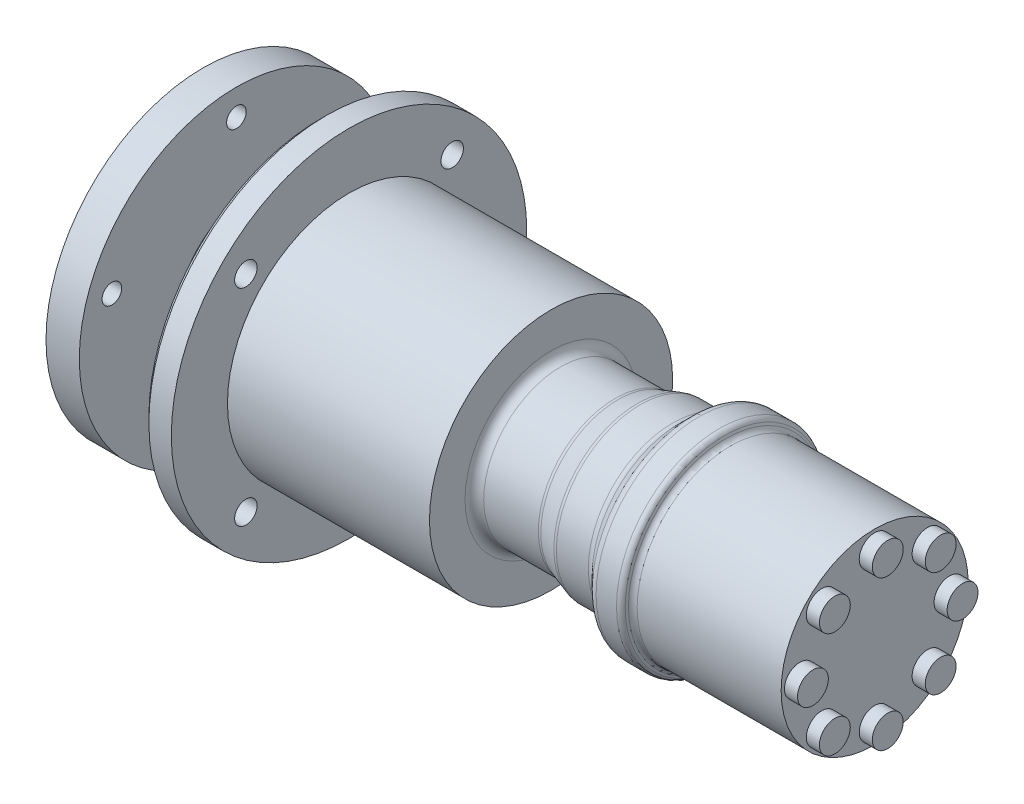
ISO-10303-21;
HEADER;
FILE_DESCRIPTION(('STEP AP214'),'2;1');
FILE_NAME('part.step','',(''),(''),'','','');
FILE_SCHEMA(('AUTOMOTIVE_DESIGN { 1 0 10303 214 1 1 1 1 }'));
ENDSEC;
DATA;
#1=APPLICATION_CONTEXT('core data for automotive mechanical design processes');
#2=APPLICATION_PROTOCOL_DEFINITION('international standard','automotive_design',2000,#1);
#3=PRODUCT_CONTEXT('',#1,'mechanical');
#4=PRODUCT('Part','Part','',(#3));
#5=PRODUCT_RELATED_PRODUCT_CATEGORY('part','',(#4));
#6=PRODUCT_DEFINITION_FORMATION('','',#4);
#7=PRODUCT_DEFINITION_CONTEXT('part definition',#1,'design');
#8=PRODUCT_DEFINITION('design','',#6,#7);
#9=PRODUCT_DEFINITION_SHAPE('','',#8);
#10=(LENGTH_UNIT() NAMED_UNIT(*) SI_UNIT(.MILLI.,.METRE.));
#11=(NAMED_UNIT(*) PLANE_ANGLE_UNIT() SI_UNIT($,.RADIAN.));
#12=(NAMED_UNIT(*) SI_UNIT($,.STERADIAN.) SOLID_ANGLE_UNIT());
#13=UNCERTAINTY_MEASURE_WITH_UNIT(LENGTH_MEASURE(1.E-05),#10,'distance_accuracy_value','');
#14=(GEOMETRIC_REPRESENTATION_CONTEXT(3) GLOBAL_UNCERTAINTY_ASSIGNED_CONTEXT((#13)) GLOBAL_UNIT_ASSIGNED_CONTEXT((#10,
#11,#12)) REPRESENTATION_CONTEXT('',''));
#15=CARTESIAN_POINT('',(0.,0.,0.));
#16=DIRECTION('',(0.,0.,1.));
#17=DIRECTION('',(1.,0.,0.));
#18=AXIS2_PLACEMENT_3D('',#15,#16,#17);
#19=CARTESIAN_POINT('',(366.,50.,0.));
#20=DIRECTION('',(-1.,0.,0.));
#21=DIRECTION('',(0.,0.,1.));
#22=AXIS2_PLACEMENT_3D('',#19,#20,#21);
#23=PLANE('',#22);
#24=CARTESIAN_POINT('',(366.,3.12396592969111E-13,-40.));
#25=DIRECTION('',(-1.,0.,0.));
#26=DIRECTION('',(0.,0.,1.));
#27=AXIS2_PLACEMENT_3D('',#24,#25,#26);
#28=CIRCLE('',#27,8.25);
#29=CARTESIAN_POINT('',(366.,3.12396592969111E-13,-31.75));
#30=VERTEX_POINT('',#29);
#31=EDGE_CURVE('E36',#30,#30,#28,.F.);
#32=ORIENTED_EDGE('',*,*,#31,.F.);
#33=EDGE_LOOP('',(#32));
#34=FACE_BOUND('',#33,.T.);
#35=CARTESIAN_POINT('',(366.,-40.,-2.08264395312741E-13));
#36=DIRECTION('',(-1.,0.,0.));
#37=DIRECTION('',(0.,0.,1.));
#38=AXIS2_PLACEMENT_3D('',#35,#36,#37);
#39=CIRCLE('',#38,8.25);
#40=CARTESIAN_POINT('',(366.,-40.,8.24999999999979));
#41=VERTEX_POINT('',#40);
#42=EDGE_CURVE('E196',#41,#41,#39,.F.);
#43=ORIENTED_EDGE('',*,*,#42,.F.);
#44=EDGE_LOOP('',(#43));
#45=FACE_BOUND('',#44,.T.);
#46=CARTESIAN_POINT('',(366.,-1.0413219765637E-13,40.));
#47=DIRECTION('',(-1.,0.,0.));
#48=DIRECTION('',(0.,0.,1.));
#49=AXIS2_PLACEMENT_3D('',#46,#47,#48);
#50=CIRCLE('',#49,8.25);
#51=CARTESIAN_POINT('',(366.,-1.0413219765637E-13,48.25));
#52=VERTEX_POINT('',#51);
#53=EDGE_CURVE('E190',#52,#52,#50,.F.);
#54=ORIENTED_EDGE('',*,*,#53,.F.);
#55=EDGE_LOOP('',(#54));
#56=FACE_BOUND('',#55,.T.);
#57=CARTESIAN_POINT('',(366.,40.,0.));
#58=DIRECTION('',(-1.,0.,0.));
#59=DIRECTION('',(0.,0.,1.));
#60=AXIS2_PLACEMENT_3D('',#57,#58,#59);
#61=CIRCLE('',#60,8.25);
#62=CARTESIAN_POINT('',(366.,40.,8.25));
#63=VERTEX_POINT('',#62);
#64=EDGE_CURVE('E184',#63,#63,#61,.F.);
#65=ORIENTED_EDGE('',*,*,#64,.F.);
#66=EDGE_LOOP('',(#65));
#67=FACE_BOUND('',#66,.T.);
#68=CARTESIAN_POINT('',(366.,0.,0.));
#69=DIRECTION('',(-1.,0.,0.));
#70=DIRECTION('',(0.,0.,1.));
#71=AXIS2_PLACEMENT_3D('',#68,#69,#70);
#72=CIRCLE('',#71,50.);
#73=CARTESIAN_POINT('',(366.,0.,50.));
#74=VERTEX_POINT('',#73);
#75=EDGE_CURVE('E94',#74,#74,#72,.T.);
#76=ORIENTED_EDGE('',*,*,#75,.F.);
#77=EDGE_LOOP('',(#76));
#78=FACE_BOUND('',#77,.T.);
#79=CARTESIAN_POINT('',(366.,28.2842712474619,28.2842712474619));
#80=DIRECTION('',(-1.,0.,0.));
#81=DIRECTION('',(0.,0.,1.));
#82=AXIS2_PLACEMENT_3D('',#79,#80,#81);
#83=CIRCLE('',#82,8.25);
#84=CARTESIAN_POINT('',(366.,28.2842712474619,36.5342712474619));
#85=VERTEX_POINT('',#84);
#86=EDGE_CURVE('E187',#85,#85,#83,.F.);
#87=ORIENTED_EDGE('',*,*,#86,.F.);
#88=EDGE_LOOP('',(#87));
#89=FACE_BOUND('',#88,.T.);
#90=CARTESIAN_POINT('',(366.,-28.284271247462,28.2842712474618));
#91=DIRECTION('',(-1.,0.,0.));
#92=DIRECTION('',(0.,0.,1.));
#93=AXIS2_PLACEMENT_3D('',#90,#91,#92);
#94=CIRCLE('',#93,8.25);
#95=CARTESIAN_POINT('',(366.,-28.284271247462,36.5342712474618));
#96=VERTEX_POINT('',#95);
#97=EDGE_CURVE('E193',#96,#96,#94,.F.);
#98=ORIENTED_EDGE('',*,*,#97,.F.);
#99=EDGE_LOOP('',(#98));
#100=FACE_BOUND('',#99,.T.);
#101=CARTESIAN_POINT('',(366.,-28.2842712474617,-28.2842712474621));
#102=DIRECTION('',(-1.,0.,0.));
#103=DIRECTION('',(0.,0.,1.));
#104=AXIS2_PLACEMENT_3D('',#101,#102,#103);
#105=CIRCLE('',#104,8.25);
#106=CARTESIAN_POINT('',(366.,-28.2842712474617,-20.0342712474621));
#107=VERTEX_POINT('',#106);
#108=EDGE_CURVE('E41',#107,#107,#105,.F.);
#109=ORIENTED_EDGE('',*,*,#108,.F.);
#110=EDGE_LOOP('',(#109));
#111=FACE_BOUND('',#110,.T.);
#112=CARTESIAN_POINT('',(366.,28.2842712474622,-28.2842712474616));
#113=DIRECTION('',(-1.,0.,0.));
#114=DIRECTION('',(0.,0.,1.));
#115=AXIS2_PLACEMENT_3D('',#112,#113,#114);
#116=CIRCLE('',#115,8.25);
#117=CARTESIAN_POINT('',(366.,28.2842712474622,-20.0342712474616));
#118=VERTEX_POINT('',#117);
#119=EDGE_CURVE('E10',#118,#118,#116,.F.);
#120=ORIENTED_EDGE('',*,*,#119,.F.);
#121=EDGE_LOOP('',(#120));
#122=FACE_BOUND('',#121,.T.);
#123=ADVANCED_FACE('F28',(#34,#45,#56,#67,#78,#89,#100,#111,#122),#23,.F.);
#124=CARTESIAN_POINT('',(0.,0.,0.));
#125=DIRECTION('',(1.,0.,0.));
#126=DIRECTION('',(0.,0.,-1.));
#127=AXIS2_PLACEMENT_3D('',#124,#125,#126);
#128=PLANE('',#127);
#129=CARTESIAN_POINT('',(0.,0.,0.));
#130=DIRECTION('',(-1.,0.,0.));
#131=DIRECTION('',(0.,0.,1.));
#132=AXIS2_PLACEMENT_3D('',#129,#130,#131);
#133=CIRCLE('',#132,42.5);
#134=CARTESIAN_POINT('',(0.,0.,42.5));
#135=VERTEX_POINT('',#134);
#136=EDGE_CURVE('E181',#135,#135,#133,.T.);
#137=ORIENTED_EDGE('',*,*,#136,.T.);
#138=EDGE_LOOP('',(#137));
#139=FACE_BOUND('',#138,.T.);
#140=ADVANCED_FACE('F30',(#139),#128,.F.);
#141=CARTESIAN_POINT('',(0.,0.,0.));
#142=DIRECTION('',(-1.,0.,0.));
#143=DIRECTION('',(0.,0.,1.));
#144=AXIS2_PLACEMENT_3D('',#141,#142,#143);
#145=CYLINDRICAL_SURFACE('',#144,42.5);
#146=ORIENTED_EDGE('',*,*,#136,.F.);
#147=EDGE_LOOP('',(#146));
#148=FACE_BOUND('',#147,.T.);
#149=CARTESIAN_POINT('',(7.,0.,0.));
#150=DIRECTION('',(-1.,0.,0.));
#151=DIRECTION('',(0.,0.,1.));
#152=AXIS2_PLACEMENT_3D('',#149,#150,#151);
#153=CIRCLE('',#152,42.5);
#154=CARTESIAN_POINT('',(7.,0.,42.5));
#155=VERTEX_POINT('',#154);
#156=EDGE_CURVE('E178',#155,#155,#153,.T.);
#157=ORIENTED_EDGE('',*,*,#156,.T.);
#158=EDGE_LOOP('',(#157));
#159=FACE_BOUND('',#158,.T.);
#160=ADVANCED_FACE('F210',(#148,#159),#145,.T.);
#161=CARTESIAN_POINT('',(7.,42.5,0.));
#162=DIRECTION('',(1.,0.,0.));
#163=DIRECTION('',(0.,0.,-1.));
#164=AXIS2_PLACEMENT_3D('',#161,#162,#163);
#165=PLANE('',#164);
#166=CARTESIAN_POINT('',(7.,21.6311896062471,-66.5739561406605));
#167=DIRECTION('',(-1.,0.,0.));
#168=DIRECTION('',(0.,0.95105651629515,0.309016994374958));
#169=AXIS2_PLACEMENT_3D('',#166,#167,#168);
#170=CIRCLE('',#169,5.25);
#171=CARTESIAN_POINT('',(7.,26.6242363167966,-64.951616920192));
#172=VERTEX_POINT('',#171);
#173=EDGE_CURVE('E810',#172,#172,#170,.T.);
#174=ORIENTED_EDGE('',*,*,#173,.F.);
#175=EDGE_LOOP('',(#174));
#176=FACE_BOUND('',#175,.T.);
#177=CARTESIAN_POINT('',(7.,-56.631189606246,-41.1449676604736));
#178=DIRECTION('',(-1.,0.,0.));
#179=DIRECTION('',(0.,0.58778525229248,-0.809016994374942));
#180=AXIS2_PLACEMENT_3D('',#177,#178,#179);
#181=CIRCLE('',#180,5.25);
#182=CARTESIAN_POINT('',(7.,-53.5453170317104,-45.3923068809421));
#183=VERTEX_POINT('',#182);
#184=EDGE_CURVE('E814',#183,#183,#181,.T.);
#185=ORIENTED_EDGE('',*,*,#184,.F.);
#186=EDGE_LOOP('',(#185));
#187=FACE_BOUND('',#186,.T.);
#188=CARTESIAN_POINT('',(7.,-56.6311896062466,41.1449676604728));
#189=DIRECTION('',(-1.,0.,0.));
#190=DIRECTION('',(0.,-0.587785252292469,-0.809016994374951));
#191=AXIS2_PLACEMENT_3D('',#188,#189,#190);
#192=CIRCLE('',#191,5.25);
#193=CARTESIAN_POINT('',(7.,-59.717062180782,36.8976284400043));
#194=VERTEX_POINT('',#193);
#195=EDGE_CURVE('E822',#194,#194,#192,.T.);
#196=ORIENTED_EDGE('',*,*,#195,.F.);
#197=EDGE_LOOP('',(#196));
#198=FACE_BOUND('',#197,.T.);
#199=CARTESIAN_POINT('',(7.,21.6311896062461,66.5739561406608));
#200=DIRECTION('',(-1.,0.,0.));
#201=DIRECTION('',(0.,-0.951056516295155,0.309016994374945));
#202=AXIS2_PLACEMENT_3D('',#199,#200,#201);
#203=CIRCLE('',#202,5.25);
#204=CARTESIAN_POINT('',(7.,16.6381428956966,68.1962953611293));
#205=VERTEX_POINT('',#204);
#206=EDGE_CURVE('E827',#205,#205,#203,.T.);
#207=ORIENTED_EDGE('',*,*,#206,.F.);
#208=EDGE_LOOP('',(#207));
#209=FACE_BOUND('',#208,.T.);
#210=CARTESIAN_POINT('',(7.,70.,0.));
#211=DIRECTION('',(-1.,0.,0.));
#212=DIRECTION('',(0.,0.,1.));
#213=AXIS2_PLACEMENT_3D('',#210,#211,#212);
#214=CIRCLE('',#213,5.25);
#215=CARTESIAN_POINT('',(7.,70.,5.25));
#216=VERTEX_POINT('',#215);
#217=EDGE_CURVE('E833',#216,#216,#214,.T.);
#218=ORIENTED_EDGE('',*,*,#217,.F.);
#219=EDGE_LOOP('',(#218));
#220=FACE_BOUND('',#219,.T.);
#221=ORIENTED_EDGE('',*,*,#156,.F.);
#222=EDGE_LOOP('',(#221));
#223=FACE_BOUND('',#222,.T.);
#224=CARTESIAN_POINT('',(7.,0.,0.));
#225=DIRECTION('',(-1.,0.,0.));
#226=DIRECTION('',(0.,0.,1.));
#227=AXIS2_PLACEMENT_3D('',#224,#225,#226);
#228=CIRCLE('',#227,84.);
#229=CARTESIAN_POINT('',(7.,0.,84.));
#230=VERTEX_POINT('',#229);
#231=EDGE_CURVE('E175',#230,#230,#228,.T.);
#232=ORIENTED_EDGE('',*,*,#231,.T.);
#233=EDGE_LOOP('',(#232));
#234=FACE_BOUND('',#233,.T.);
#235=ADVANCED_FACE('F325',(#176,#187,#198,#209,#220,#223,#234),#165,.F.);
#236=CARTESIAN_POINT('',(0.,0.,0.));
#237=DIRECTION('',(-1.,0.,0.));
#238=DIRECTION('',(0.,0.,1.));
#239=AXIS2_PLACEMENT_3D('',#236,#237,#238);
#240=CYLINDRICAL_SURFACE('',#239,84.);
#241=ORIENTED_EDGE('',*,*,#231,.F.);
#242=EDGE_LOOP('',(#241));
#243=FACE_BOUND('',#242,.T.);
#244=CARTESIAN_POINT('',(24.8,0.,0.));
#245=DIRECTION('',(-1.,0.,0.));
#246=DIRECTION('',(0.,0.,1.));
#247=AXIS2_PLACEMENT_3D('',#244,#245,#246);
#248=CIRCLE('',#247,84.);
#249=CARTESIAN_POINT('',(24.8,0.,84.));
#250=VERTEX_POINT('',#249);
#251=EDGE_CURVE('E172',#250,#250,#248,.T.);
#252=ORIENTED_EDGE('',*,*,#251,.T.);
#253=EDGE_LOOP('',(#252));
#254=FACE_BOUND('',#253,.T.);
#255=ADVANCED_FACE('F321',(#243,#254),#240,.T.);
#256=CARTESIAN_POINT('',(24.8,84.,0.));
#257=DIRECTION('',(-1.,0.,0.));
#258=DIRECTION('',(0.,0.,1.));
#259=AXIS2_PLACEMENT_3D('',#256,#257,#258);
#260=PLANE('',#259);
#261=CARTESIAN_POINT('',(24.8,21.6311896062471,-66.5739561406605));
#262=DIRECTION('',(-1.,0.,0.));
#263=DIRECTION('',(0.,0.,1.));
#264=AXIS2_PLACEMENT_3D('',#261,#262,#263);
#265=CIRCLE('',#264,5.25);
#266=CARTESIAN_POINT('',(24.8,21.6311896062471,-61.3239561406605));
#267=VERTEX_POINT('',#266);
#268=EDGE_CURVE('E813',#267,#267,#265,.F.);
#269=ORIENTED_EDGE('',*,*,#268,.F.);
#270=EDGE_LOOP('',(#269));
#271=FACE_BOUND('',#270,.T.);
#272=CARTESIAN_POINT('',(24.8,-56.631189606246,-41.1449676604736));
#273=DIRECTION('',(-1.,0.,0.));
#274=DIRECTION('',(0.,0.,1.));
#275=AXIS2_PLACEMENT_3D('',#272,#273,#274);
#276=CIRCLE('',#275,5.25);
#277=CARTESIAN_POINT('',(24.8,-56.631189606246,-35.8949676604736));
#278=VERTEX_POINT('',#277);
#279=EDGE_CURVE('E817',#278,#278,#276,.F.);
#280=ORIENTED_EDGE('',*,*,#279,.F.);
#281=EDGE_LOOP('',(#280));
#282=FACE_BOUND('',#281,.T.);
#283=CARTESIAN_POINT('',(24.8,-56.6311896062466,41.1449676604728));
#284=DIRECTION('',(-1.,0.,0.));
#285=DIRECTION('',(0.,0.,1.));
#286=AXIS2_PLACEMENT_3D('',#283,#284,#285);
#287=CIRCLE('',#286,5.25);
#288=CARTESIAN_POINT('',(24.8,-56.6311896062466,46.3949676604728));
#289=VERTEX_POINT('',#288);
#290=EDGE_CURVE('E824',#289,#289,#287,.F.);
#291=ORIENTED_EDGE('',*,*,#290,.F.);
#292=EDGE_LOOP('',(#291));
#293=FACE_BOUND('',#292,.T.);
#294=CARTESIAN_POINT('',(24.8,21.6311896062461,66.5739561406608));
#295=DIRECTION('',(-1.,0.,0.));
#296=DIRECTION('',(0.,0.,1.));
#297=AXIS2_PLACEMENT_3D('',#294,#295,#296);
#298=CIRCLE('',#297,5.25);
#299=CARTESIAN_POINT('',(24.8,21.6311896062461,71.8239561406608));
#300=VERTEX_POINT('',#299);
#301=EDGE_CURVE('E830',#300,#300,#298,.F.);
#302=ORIENTED_EDGE('',*,*,#301,.F.);
#303=EDGE_LOOP('',(#302));
#304=FACE_BOUND('',#303,.T.);
#305=CARTESIAN_POINT('',(24.8,70.,0.));
#306=DIRECTION('',(-1.,0.,0.));
#307=DIRECTION('',(0.,0.,1.));
#308=AXIS2_PLACEMENT_3D('',#305,#306,#307);
#309=CIRCLE('',#308,5.25);
#310=CARTESIAN_POINT('',(24.8,70.,5.25));
#311=VERTEX_POINT('',#310);
#312=EDGE_CURVE('E836',#311,#311,#309,.F.);
#313=ORIENTED_EDGE('',*,*,#312,.F.);
#314=EDGE_LOOP('',(#313));
#315=FACE_BOUND('',#314,.T.);
#316=ORIENTED_EDGE('',*,*,#251,.F.);
#317=EDGE_LOOP('',(#316));
#318=FACE_BOUND('',#317,.T.);
#319=CARTESIAN_POINT('',(24.8,0.,0.));
#320=DIRECTION('',(-1.,0.,0.));
#321=DIRECTION('',(0.,0.,1.));
#322=AXIS2_PLACEMENT_3D('',#319,#320,#321);
#323=CIRCLE('',#322,27.4);
#324=CARTESIAN_POINT('',(24.8,0.,27.4));
#325=VERTEX_POINT('',#324);
#326=EDGE_CURVE('E169',#325,#325,#323,.T.);
#327=ORIENTED_EDGE('',*,*,#326,.T.);
#328=EDGE_LOOP('',(#327));
#329=FACE_BOUND('',#328,.T.);
#330=ADVANCED_FACE('F317',(#271,#282,#293,#304,#315,#318,#329),#260,.F.);
#331=CARTESIAN_POINT('',(0.,0.,0.));
#332=DIRECTION('',(-1.,0.,0.));
#333=DIRECTION('',(0.,0.,1.));
#334=AXIS2_PLACEMENT_3D('',#331,#332,#333);
#335=CYLINDRICAL_SURFACE('',#334,27.4);
#336=ORIENTED_EDGE('',*,*,#326,.F.);
#337=EDGE_LOOP('',(#336));
#338=FACE_BOUND('',#337,.T.);
#339=CARTESIAN_POINT('',(33.,0.,0.));
#340=DIRECTION('',(-1.,0.,0.));
#341=DIRECTION('',(0.,0.,1.));
#342=AXIS2_PLACEMENT_3D('',#339,#340,#341);
#343=CIRCLE('',#342,27.4);
#344=CARTESIAN_POINT('',(33.,0.,27.4));
#345=VERTEX_POINT('',#344);
#346=EDGE_CURVE('E166',#345,#345,#343,.T.);
#347=ORIENTED_EDGE('',*,*,#346,.T.);
#348=EDGE_LOOP('',(#347));
#349=FACE_BOUND('',#348,.T.);
#350=ADVANCED_FACE('F313',(#338,#349),#335,.T.);
#351=CARTESIAN_POINT('',(33.,27.4,0.));
#352=DIRECTION('',(1.,0.,0.));
#353=DIRECTION('',(0.,0.,-1.));
#354=AXIS2_PLACEMENT_3D('',#351,#352,#353);
#355=PLANE('',#354);
#356=ORIENTED_EDGE('',*,*,#346,.F.);
#357=EDGE_LOOP('',(#356));
#358=FACE_BOUND('',#357,.T.);
#359=CARTESIAN_POINT('',(33.,0.,0.));
#360=DIRECTION('',(-1.,0.,0.));
#361=DIRECTION('',(0.,0.,1.));
#362=AXIS2_PLACEMENT_3D('',#359,#360,#361);
#363=CIRCLE('',#362,40.1);
#364=CARTESIAN_POINT('',(33.,0.,40.1));
#365=VERTEX_POINT('',#364);
#366=EDGE_CURVE('E163',#365,#365,#363,.T.);
#367=ORIENTED_EDGE('',*,*,#366,.T.);
#368=EDGE_LOOP('',(#367));
#369=FACE_BOUND('',#368,.T.);
#370=ADVANCED_FACE('F309',(#358,#369),#355,.F.);
#371=CARTESIAN_POINT('',(0.,0.,0.));
#372=DIRECTION('',(-1.,0.,0.));
#373=DIRECTION('',(0.,0.,1.));
#374=AXIS2_PLACEMENT_3D('',#371,#372,#373);
#375=CYLINDRICAL_SURFACE('',#374,40.1);
#376=ORIENTED_EDGE('',*,*,#366,.F.);
#377=EDGE_LOOP('',(#376));
#378=FACE_BOUND('',#377,.T.);
#379=CARTESIAN_POINT('',(37.,0.,0.));
#380=DIRECTION('',(-1.,0.,0.));
#381=DIRECTION('',(0.,0.,1.));
#382=AXIS2_PLACEMENT_3D('',#379,#380,#381);
#383=CIRCLE('',#382,40.1);
#384=CARTESIAN_POINT('',(37.,0.,40.1));
#385=VERTEX_POINT('',#384);
#386=EDGE_CURVE('E160',#385,#385,#383,.T.);
#387=ORIENTED_EDGE('',*,*,#386,.T.);
#388=EDGE_LOOP('',(#387));
#389=FACE_BOUND('',#388,.T.);
#390=ADVANCED_FACE('F305',(#378,#389),#375,.T.);
#391=CARTESIAN_POINT('',(37.,40.1,0.));
#392=DIRECTION('',(1.,0.,0.));
#393=DIRECTION('',(0.,0.,-1.));
#394=AXIS2_PLACEMENT_3D('',#391,#392,#393);
#395=PLANE('',#394);
#396=ORIENTED_EDGE('',*,*,#386,.F.);
#397=EDGE_LOOP('',(#396));
#398=FACE_BOUND('',#397,.T.);
#399=CARTESIAN_POINT('',(37.,0.,0.));
#400=DIRECTION('',(-1.,0.,0.));
#401=DIRECTION('',(0.,0.,1.));
#402=AXIS2_PLACEMENT_3D('',#399,#400,#401);
#403=CIRCLE('',#402,43.9);
#404=CARTESIAN_POINT('',(37.,0.,43.9));
#405=VERTEX_POINT('',#404);
#406=EDGE_CURVE('E157',#405,#405,#403,.T.);
#407=ORIENTED_EDGE('',*,*,#406,.T.);
#408=EDGE_LOOP('',(#407));
#409=FACE_BOUND('',#408,.T.);
#410=ADVANCED_FACE('F301',(#398,#409),#395,.F.);
#411=CARTESIAN_POINT('',(70.,0.,0.));
#412=DIRECTION('',(1.,0.,0.));
#413=DIRECTION('',(0.,0.,-1.));
#414=AXIS2_PLACEMENT_3D('',#411,#412,#413);
#415=CONICAL_SURFACE('',#414,54.9,0.321750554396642);
#416=ORIENTED_EDGE('',*,*,#406,.F.);
#417=EDGE_LOOP('',(#416));
#418=FACE_BOUND('',#417,.T.);
#419=CARTESIAN_POINT('',(70.,0.,0.));
#420=DIRECTION('',(-1.,0.,0.));
#421=DIRECTION('',(0.,0.,1.));
#422=AXIS2_PLACEMENT_3D('',#419,#420,#421);
#423=CIRCLE('',#422,54.9);
#424=CARTESIAN_POINT('',(70.,0.,54.9));
#425=VERTEX_POINT('',#424);
#426=EDGE_CURVE('E154',#425,#425,#423,.T.);
#427=ORIENTED_EDGE('',*,*,#426,.T.);
#428=EDGE_LOOP('',(#427));
#429=FACE_BOUND('',#428,.T.);
#430=ADVANCED_FACE('F297',(#418,#429),#415,.T.);
#431=CARTESIAN_POINT('',(70.,54.9,0.));
#432=DIRECTION('',(1.,0.,0.));
#433=DIRECTION('',(0.,0.,-1.));
#434=AXIS2_PLACEMENT_3D('',#431,#432,#433);
#435=PLANE('',#434);
#436=CARTESIAN_POINT('',(70.,55.15,55.1413424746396));
#437=DIRECTION('',(-1.,0.,0.));
#438=DIRECTION('',(0.,0.,1.));
#439=AXIS2_PLACEMENT_3D('',#436,#437,#438);
#440=CIRCLE('',#439,5.99999999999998);
#441=CARTESIAN_POINT('',(70.,55.15,61.1413424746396));
#442=VERTEX_POINT('',#441);
#443=EDGE_CURVE('E65',#442,#442,#440,.T.);
#444=ORIENTED_EDGE('',*,*,#443,.F.);
#445=EDGE_LOOP('',(#444));
#446=FACE_BOUND('',#445,.T.);
#447=CARTESIAN_POINT('',(70.,-55.15,55.1413424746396));
#448=DIRECTION('',(-1.,0.,0.));
#449=DIRECTION('',(0.,0.,1.));
#450=AXIS2_PLACEMENT_3D('',#447,#448,#449);
#451=CIRCLE('',#450,5.99999999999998);
#452=CARTESIAN_POINT('',(70.,-55.15,61.1413424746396));
#453=VERTEX_POINT('',#452);
#454=EDGE_CURVE('E55',#453,#453,#451,.T.);
#455=ORIENTED_EDGE('',*,*,#454,.F.);
#456=EDGE_LOOP('',(#455));
#457=FACE_BOUND('',#456,.T.);
#458=CARTESIAN_POINT('',(70.,-55.15,-55.1586575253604));
#459=DIRECTION('',(-1.,0.,0.));
#460=DIRECTION('',(0.,0.,1.));
#461=AXIS2_PLACEMENT_3D('',#458,#459,#460);
#462=CIRCLE('',#461,5.99999999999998);
#463=CARTESIAN_POINT('',(70.,-55.15,-49.1586575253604));
#464=VERTEX_POINT('',#463);
#465=EDGE_CURVE('E52',#464,#464,#462,.T.);
#466=ORIENTED_EDGE('',*,*,#465,.F.);
#467=EDGE_LOOP('',(#466));
#468=FACE_BOUND('',#467,.T.);
#469=CARTESIAN_POINT('',(70.,55.15,-55.1586575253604));
#470=DIRECTION('',(-1.,0.,0.));
#471=DIRECTION('',(0.,0.,1.));
#472=AXIS2_PLACEMENT_3D('',#469,#470,#471);
#473=CIRCLE('',#472,5.99999999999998);
#474=CARTESIAN_POINT('',(70.,55.15,-49.1586575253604));
#475=VERTEX_POINT('',#474);
#476=EDGE_CURVE('E49',#475,#475,#473,.T.);
#477=ORIENTED_EDGE('',*,*,#476,.F.);
#478=EDGE_LOOP('',(#477));
#479=FACE_BOUND('',#478,.T.);
#480=ORIENTED_EDGE('',*,*,#426,.F.);
#481=EDGE_LOOP('',(#480));
#482=FACE_BOUND('',#481,.T.);
#483=CARTESIAN_POINT('',(70.,0.,0.));
#484=DIRECTION('',(-1.,0.,0.));
#485=DIRECTION('',(0.,0.,1.));
#486=AXIS2_PLACEMENT_3D('',#483,#484,#485);
#487=CIRCLE('',#486,92.);
#488=CARTESIAN_POINT('',(70.,0.,92.));
#489=VERTEX_POINT('',#488);
#490=EDGE_CURVE('E151',#489,#489,#487,.T.);
#491=ORIENTED_EDGE('',*,*,#490,.T.);
#492=EDGE_LOOP('',(#491));
#493=FACE_BOUND('',#492,.T.);
#494=ADVANCED_FACE('F293',(#446,#457,#468,#479,#482,#493),#435,.F.);
#495=CARTESIAN_POINT('',(73.,0.,0.));
#496=DIRECTION('',(1.,0.,0.));
#497=DIRECTION('',(0.,0.,-1.));
#498=AXIS2_PLACEMENT_3D('',#495,#496,#497);
#499=CONICAL_SURFACE('',#498,95.,0.785398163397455);
#500=ORIENTED_EDGE('',*,*,#490,.F.);
#501=EDGE_LOOP('',(#500));
#502=FACE_BOUND('',#501,.T.);
#503=CARTESIAN_POINT('',(73.,0.,0.));
#504=DIRECTION('',(-1.,0.,0.));
#505=DIRECTION('',(0.,0.,1.));
#506=AXIS2_PLACEMENT_3D('',#503,#504,#505);
#507=CIRCLE('',#506,95.);
#508=CARTESIAN_POINT('',(73.,0.,95.));
#509=VERTEX_POINT('',#508);
#510=EDGE_CURVE('E148',#509,#509,#507,.T.);
#511=ORIENTED_EDGE('',*,*,#510,.T.);
#512=EDGE_LOOP('',(#511));
#513=FACE_BOUND('',#512,.T.);
#514=ADVANCED_FACE('F289',(#502,#513),#499,.T.);
#515=CARTESIAN_POINT('',(0.,0.,0.));
#516=DIRECTION('',(-1.,0.,0.));
#517=DIRECTION('',(0.,0.,1.));
#518=AXIS2_PLACEMENT_3D('',#515,#516,#517);
#519=CYLINDRICAL_SURFACE('',#518,95.);
#520=ORIENTED_EDGE('',*,*,#510,.F.);
#521=EDGE_LOOP('',(#520));
#522=FACE_BOUND('',#521,.T.);
#523=CARTESIAN_POINT('',(85.,0.,0.));
#524=DIRECTION('',(-1.,0.,0.));
#525=DIRECTION('',(0.,0.,1.));
#526=AXIS2_PLACEMENT_3D('',#523,#524,#525);
#527=CIRCLE('',#526,95.);
#528=CARTESIAN_POINT('',(85.,0.,95.));
#529=VERTEX_POINT('',#528);
#530=EDGE_CURVE('E145',#529,#529,#527,.T.);
#531=ORIENTED_EDGE('',*,*,#530,.T.);
#532=EDGE_LOOP('',(#531));
#533=FACE_BOUND('',#532,.T.);
#534=ADVANCED_FACE('F285',(#522,#533),#519,.T.);
#535=CARTESIAN_POINT('',(85.,95.,0.));
#536=DIRECTION('',(-1.,0.,0.));
#537=DIRECTION('',(0.,0.,1.));
#538=AXIS2_PLACEMENT_3D('',#535,#536,#537);
#539=PLANE('',#538);
#540=CARTESIAN_POINT('',(85.,55.15,55.1413424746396));
#541=DIRECTION('',(-1.,0.,0.));
#542=DIRECTION('',(0.,0.,1.));
#543=AXIS2_PLACEMENT_3D('',#540,#541,#542);
#544=CIRCLE('',#543,5.99999999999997);
#545=CARTESIAN_POINT('',(85.,55.15,61.1413424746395));
#546=VERTEX_POINT('',#545);
#547=EDGE_CURVE('E32',#546,#546,#544,.T.);
#548=ORIENTED_EDGE('',*,*,#547,.T.);
#549=EDGE_LOOP('',(#548));
#550=FACE_BOUND('',#549,.T.);
#551=CARTESIAN_POINT('',(85.,-55.15,55.1413424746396));
#552=DIRECTION('',(-1.,0.,0.));
#553=DIRECTION('',(0.,0.,1.));
#554=AXIS2_PLACEMENT_3D('',#551,#552,#553);
#555=CIRCLE('',#554,5.99999999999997);
#556=CARTESIAN_POINT('',(85.,-55.15,61.1413424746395));
#557=VERTEX_POINT('',#556);
#558=EDGE_CURVE('E53',#557,#557,#555,.T.);
#559=ORIENTED_EDGE('',*,*,#558,.T.);
#560=EDGE_LOOP('',(#559));
#561=FACE_BOUND('',#560,.T.);
#562=CARTESIAN_POINT('',(85.,-55.15,-55.1586575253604));
#563=DIRECTION('',(-1.,0.,0.));
#564=DIRECTION('',(0.,0.,1.));
#565=AXIS2_PLACEMENT_3D('',#562,#563,#564);
#566=CIRCLE('',#565,5.99999999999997);
#567=CARTESIAN_POINT('',(85.,-55.15,-49.1586575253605));
#568=VERTEX_POINT('',#567);
#569=EDGE_CURVE('E50',#568,#568,#566,.T.);
#570=ORIENTED_EDGE('',*,*,#569,.T.);
#571=EDGE_LOOP('',(#570));
#572=FACE_BOUND('',#571,.T.);
#573=CARTESIAN_POINT('',(85.,55.15,-55.1586575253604));
#574=DIRECTION('',(-1.,0.,0.));
#575=DIRECTION('',(0.,0.,1.));
#576=AXIS2_PLACEMENT_3D('',#573,#574,#575);
#577=CIRCLE('',#576,5.99999999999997);
#578=CARTESIAN_POINT('',(85.,55.15,-49.1586575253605));
#579=VERTEX_POINT('',#578);
#580=EDGE_CURVE('E45',#579,#579,#577,.T.);
#581=ORIENTED_EDGE('',*,*,#580,.T.);
#582=EDGE_LOOP('',(#581));
#583=FACE_BOUND('',#582,.T.);
#584=ORIENTED_EDGE('',*,*,#530,.F.);
#585=EDGE_LOOP('',(#584));
#586=FACE_BOUND('',#585,.T.);
#587=CARTESIAN_POINT('',(85.,0.,0.));
#588=DIRECTION('',(-1.,0.,0.));
#589=DIRECTION('',(0.,0.,1.));
#590=AXIS2_PLACEMENT_3D('',#587,#588,#589);
#591=CIRCLE('',#590,65.);
#592=CARTESIAN_POINT('',(85.,0.,65.));
#593=VERTEX_POINT('',#592);
#594=EDGE_CURVE('E142',#593,#593,#591,.T.);
#595=ORIENTED_EDGE('',*,*,#594,.T.);
#596=EDGE_LOOP('',(#595));
#597=FACE_BOUND('',#596,.T.);
#598=ADVANCED_FACE('F281',(#550,#561,#572,#583,#586,#597),#539,.F.);
#599=CARTESIAN_POINT('',(0.,0.,0.));
#600=DIRECTION('',(-1.,0.,0.));
#601=DIRECTION('',(0.,0.,1.));
#602=AXIS2_PLACEMENT_3D('',#599,#600,#601);
#603=CYLINDRICAL_SURFACE('',#602,65.);
#604=ORIENTED_EDGE('',*,*,#594,.F.);
#605=EDGE_LOOP('',(#604));
#606=FACE_BOUND('',#605,.T.);
#607=CARTESIAN_POINT('',(193.,0.,0.));
#608=DIRECTION('',(-1.,0.,0.));
#609=DIRECTION('',(0.,0.,1.));
#610=AXIS2_PLACEMENT_3D('',#607,#608,#609);
#611=CIRCLE('',#610,65.);
#612=CARTESIAN_POINT('',(193.,0.,65.));
#613=VERTEX_POINT('',#612);
#614=EDGE_CURVE('E139',#613,#613,#611,.T.);
#615=ORIENTED_EDGE('',*,*,#614,.T.);
#616=EDGE_LOOP('',(#615));
#617=FACE_BOUND('',#616,.T.);
#618=ADVANCED_FACE('F277',(#606,#617),#603,.T.);
#619=CARTESIAN_POINT('',(193.,65.,0.));
#620=DIRECTION('',(-1.,0.,0.));
#621=DIRECTION('',(0.,0.,1.));
#622=AXIS2_PLACEMENT_3D('',#619,#620,#621);
#623=PLANE('',#622);
#624=ORIENTED_EDGE('',*,*,#614,.F.);
#625=EDGE_LOOP('',(#624));
#626=FACE_BOUND('',#625,.T.);
#627=CARTESIAN_POINT('',(193.,0.,0.));
#628=DIRECTION('',(-1.,0.,0.));
#629=DIRECTION('',(0.,0.,1.));
#630=AXIS2_PLACEMENT_3D('',#627,#628,#629);
#631=CIRCLE('',#630,46.);
#632=CARTESIAN_POINT('',(193.,0.,46.));
#633=VERTEX_POINT('',#632);
#634=EDGE_CURVE('E136',#633,#633,#631,.T.);
#635=ORIENTED_EDGE('',*,*,#634,.T.);
#636=EDGE_LOOP('',(#635));
#637=FACE_BOUND('',#636,.T.);
#638=ADVANCED_FACE('F273',(#626,#637),#623,.F.);
#639=CARTESIAN_POINT('',(198.,0.,0.));
#640=DIRECTION('',(-1.,0.,0.));
#641=DIRECTION('',(0.,0.,1.));
#642=AXIS2_PLACEMENT_3D('',#639,#640,#641);
#643=TOROIDAL_SURFACE('',#642,46.,5.);
#644=ORIENTED_EDGE('',*,*,#634,.F.);
#645=EDGE_LOOP('',(#644));
#646=FACE_BOUND('',#645,.T.);
#647=CARTESIAN_POINT('',(198.,0.,0.));
#648=DIRECTION('',(-1.,0.,0.));
#649=DIRECTION('',(0.,0.,1.));
#650=AXIS2_PLACEMENT_3D('',#647,#648,#649);
#651=CIRCLE('',#650,41.);
#652=CARTESIAN_POINT('',(198.,0.,41.));
#653=VERTEX_POINT('',#652);
#654=EDGE_CURVE('E133',#653,#653,#651,.T.);
#655=ORIENTED_EDGE('',*,*,#654,.T.);
#656=EDGE_LOOP('',(#655));
#657=FACE_BOUND('',#656,.T.);
#658=ADVANCED_FACE('F269',(#646,#657),#643,.F.);
#659=CARTESIAN_POINT('',(0.,0.,0.));
#660=DIRECTION('',(-1.,0.,0.));
#661=DIRECTION('',(0.,0.,1.));
#662=AXIS2_PLACEMENT_3D('',#659,#660,#661);
#663=CYLINDRICAL_SURFACE('',#662,41.);
#664=ORIENTED_EDGE('',*,*,#654,.F.);
#665=EDGE_LOOP('',(#664));
#666=FACE_BOUND('',#665,.T.);
#667=CARTESIAN_POINT('',(227.188611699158,0.,0.));
#668=DIRECTION('',(-1.,0.,0.));
#669=DIRECTION('',(0.,0.,1.));
#670=AXIS2_PLACEMENT_3D('',#667,#668,#669);
#671=CIRCLE('',#670,41.);
#672=CARTESIAN_POINT('',(227.188611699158,0.,41.));
#673=VERTEX_POINT('',#672);
#674=EDGE_CURVE('E130',#673,#673,#671,.T.);
#675=ORIENTED_EDGE('',*,*,#674,.T.);
#676=EDGE_LOOP('',(#675));
#677=FACE_BOUND('',#676,.T.);
#678=ADVANCED_FACE('F265',(#666,#677),#663,.T.);
#679=CARTESIAN_POINT('',(227.188611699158,0.,0.));
#680=DIRECTION('',(-1.,0.,0.));
#681=DIRECTION('',(0.,0.,1.));
#682=AXIS2_PLACEMENT_3D('',#679,#680,#681);
#683=TOROIDAL_SURFACE('',#682,46.,5.);
#684=ORIENTED_EDGE('',*,*,#674,.F.);
#685=EDGE_LOOP('',(#684));
#686=FACE_BOUND('',#685,.T.);
#687=CARTESIAN_POINT('',(228.769750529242,0.,0.));
#688=DIRECTION('',(-1.,0.,0.));
#689=DIRECTION('',(0.,0.,1.));
#690=AXIS2_PLACEMENT_3D('',#687,#688,#689);
#691=CIRCLE('',#690,41.2565835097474);
#692=CARTESIAN_POINT('',(228.769750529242,0.,41.2565835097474));
#693=VERTEX_POINT('',#692);
#694=EDGE_CURVE('E127',#693,#693,#691,.T.);
#695=ORIENTED_EDGE('',*,*,#694,.T.);
#696=EDGE_LOOP('',(#695));
#697=FACE_BOUND('',#696,.T.);
#698=ADVANCED_FACE('F261',(#686,#697),#683,.F.);
#699=CARTESIAN_POINT('',(239.230249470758,0.,0.));
#700=DIRECTION('',(1.,0.,0.));
#701=DIRECTION('',(0.,0.,-1.));
#702=AXIS2_PLACEMENT_3D('',#699,#700,#701);
#703=CONICAL_SURFACE('',#702,44.7434164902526,0.321750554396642);
#704=ORIENTED_EDGE('',*,*,#694,.F.);
#705=EDGE_LOOP('',(#704));
#706=FACE_BOUND('',#705,.T.);
#707=CARTESIAN_POINT('',(239.230249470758,0.,0.));
#708=DIRECTION('',(-1.,0.,0.));
#709=DIRECTION('',(0.,0.,1.));
#710=AXIS2_PLACEMENT_3D('',#707,#708,#709);
#711=CIRCLE('',#710,44.7434164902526);
#712=CARTESIAN_POINT('',(239.230249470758,0.,44.7434164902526));
#713=VERTEX_POINT('',#712);
#714=EDGE_CURVE('E124',#713,#713,#711,.T.);
#715=ORIENTED_EDGE('',*,*,#714,.T.);
#716=EDGE_LOOP('',(#715));
#717=FACE_BOUND('',#716,.T.);
#718=ADVANCED_FACE('F257',(#706,#717),#703,.T.);
#719=CARTESIAN_POINT('',(240.811388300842,0.,0.));
#720=DIRECTION('',(-1.,0.,0.));
#721=DIRECTION('',(0.,0.,1.));
#722=AXIS2_PLACEMENT_3D('',#719,#720,#721);
#723=TOROIDAL_SURFACE('',#722,40.,5.);
#724=ORIENTED_EDGE('',*,*,#714,.F.);
#725=EDGE_LOOP('',(#724));
#726=FACE_BOUND('',#725,.T.);
#727=CARTESIAN_POINT('',(240.811388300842,0.,0.));
#728=DIRECTION('',(-1.,0.,0.));
#729=DIRECTION('',(0.,0.,1.));
#730=AXIS2_PLACEMENT_3D('',#727,#728,#729);
#731=CIRCLE('',#730,45.);
#732=CARTESIAN_POINT('',(240.811388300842,0.,45.));
#733=VERTEX_POINT('',#732);
#734=EDGE_CURVE('E121',#733,#733,#731,.T.);
#735=ORIENTED_EDGE('',*,*,#734,.T.);
#736=EDGE_LOOP('',(#735));
#737=FACE_BOUND('',#736,.T.);
#738=ADVANCED_FACE('F253',(#726,#737),#723,.T.);
#739=CARTESIAN_POINT('',(0.,0.,0.));
#740=DIRECTION('',(-1.,0.,0.));
#741=DIRECTION('',(0.,0.,1.));
#742=AXIS2_PLACEMENT_3D('',#739,#740,#741);
#743=CYLINDRICAL_SURFACE('',#742,45.);
#744=ORIENTED_EDGE('',*,*,#734,.F.);
#745=EDGE_LOOP('',(#744));
#746=FACE_BOUND('',#745,.T.);
#747=CARTESIAN_POINT('',(257.928932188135,0.,0.));
#748=DIRECTION('',(-1.,0.,0.));
#749=DIRECTION('',(0.,0.,1.));
#750=AXIS2_PLACEMENT_3D('',#747,#748,#749);
#751=CIRCLE('',#750,45.);
#752=CARTESIAN_POINT('',(257.928932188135,0.,45.));
#753=VERTEX_POINT('',#752);
#754=EDGE_CURVE('E118',#753,#753,#751,.T.);
#755=ORIENTED_EDGE('',*,*,#754,.T.);
#756=EDGE_LOOP('',(#755));
#757=FACE_BOUND('',#756,.T.);
#758=ADVANCED_FACE('F249',(#746,#757),#743,.T.);
#759=CARTESIAN_POINT('',(257.928932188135,0.,0.));
#760=DIRECTION('',(-1.,0.,0.));
#761=DIRECTION('',(0.,0.,1.));
#762=AXIS2_PLACEMENT_3D('',#759,#760,#761);
#763=TOROIDAL_SURFACE('',#762,50.,5.00000000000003);
#764=ORIENTED_EDGE('',*,*,#754,.F.);
#765=EDGE_LOOP('',(#764));
#766=FACE_BOUND('',#765,.T.);
#767=CARTESIAN_POINT('',(261.464466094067,0.,0.));
#768=DIRECTION('',(-1.,0.,0.));
#769=DIRECTION('',(0.,0.,1.));
#770=AXIS2_PLACEMENT_3D('',#767,#768,#769);
#771=CIRCLE('',#770,46.4644660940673);
#772=CARTESIAN_POINT('',(261.464466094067,0.,46.4644660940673));
#773=VERTEX_POINT('',#772);
#774=EDGE_CURVE('E115',#773,#773,#771,.T.);
#775=ORIENTED_EDGE('',*,*,#774,.T.);
#776=EDGE_LOOP('',(#775));
#777=FACE_BOUND('',#776,.T.);
#778=ADVANCED_FACE('F245',(#766,#777),#763,.F.);
#779=CARTESIAN_POINT('',(268.535533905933,0.,0.));
#780=DIRECTION('',(1.,0.,0.));
#781=DIRECTION('',(0.,0.,-1.));
#782=AXIS2_PLACEMENT_3D('',#779,#780,#781);
#783=CONICAL_SURFACE('',#782,53.5355339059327,0.785398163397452);
#784=ORIENTED_EDGE('',*,*,#774,.F.);
#785=EDGE_LOOP('',(#784));
#786=FACE_BOUND('',#785,.T.);
#787=CARTESIAN_POINT('',(268.535533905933,0.,0.));
#788=DIRECTION('',(-1.,0.,0.));
#789=DIRECTION('',(0.,0.,1.));
#790=AXIS2_PLACEMENT_3D('',#787,#788,#789);
#791=CIRCLE('',#790,53.5355339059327);
#792=CARTESIAN_POINT('',(268.535533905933,0.,53.5355339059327));
#793=VERTEX_POINT('',#792);
#794=EDGE_CURVE('E112',#793,#793,#791,.T.);
#795=ORIENTED_EDGE('',*,*,#794,.T.);
#796=EDGE_LOOP('',(#795));
#797=FACE_BOUND('',#796,.T.);
#798=ADVANCED_FACE('F241',(#786,#797),#783,.T.);
#799=CARTESIAN_POINT('',(272.071067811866,0.,0.));
#800=DIRECTION('',(-1.,0.,0.));
#801=DIRECTION('',(0.,0.,1.));
#802=AXIS2_PLACEMENT_3D('',#799,#800,#801);
#803=TOROIDAL_SURFACE('',#802,50.,5.);
#804=ORIENTED_EDGE('',*,*,#794,.F.);
#805=EDGE_LOOP('',(#804));
#806=FACE_BOUND('',#805,.T.);
#807=CARTESIAN_POINT('',(272.071067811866,0.,0.));
#808=DIRECTION('',(-1.,0.,0.));
#809=DIRECTION('',(0.,0.,1.));
#810=AXIS2_PLACEMENT_3D('',#807,#808,#809);
#811=CIRCLE('',#810,55.);
#812=CARTESIAN_POINT('',(272.071067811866,0.,55.));
#813=VERTEX_POINT('',#812);
#814=EDGE_CURVE('E109',#813,#813,#811,.T.);
#815=ORIENTED_EDGE('',*,*,#814,.T.);
#816=EDGE_LOOP('',(#815));
#817=FACE_BOUND('',#816,.T.);
#818=ADVANCED_FACE('F237',(#806,#817),#803,.T.);
#819=CARTESIAN_POINT('',(0.,0.,0.));
#820=DIRECTION('',(-1.,0.,0.));
#821=DIRECTION('',(0.,0.,1.));
#822=AXIS2_PLACEMENT_3D('',#819,#820,#821);
#823=CYLINDRICAL_SURFACE('',#822,55.);
#824=ORIENTED_EDGE('',*,*,#814,.F.);
#825=EDGE_LOOP('',(#824));
#826=FACE_BOUND('',#825,.T.);
#827=CARTESIAN_POINT('',(282.968901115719,0.,0.));
#828=DIRECTION('',(-1.,0.,0.));
#829=DIRECTION('',(0.,0.,1.));
#830=AXIS2_PLACEMENT_3D('',#827,#828,#829);
#831=CIRCLE('',#830,55.);
#832=CARTESIAN_POINT('',(282.968901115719,0.,55.));
#833=VERTEX_POINT('',#832);
#834=EDGE_CURVE('E106',#833,#833,#831,.T.);
#835=ORIENTED_EDGE('',*,*,#834,.T.);
#836=EDGE_LOOP('',(#835));
#837=FACE_BOUND('',#836,.T.);
#838=ADVANCED_FACE('F233',(#826,#837),#823,.T.);
#839=CARTESIAN_POINT('',(282.968901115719,0.,0.));
#840=DIRECTION('',(-1.,0.,0.));
#841=DIRECTION('',(0.,0.,1.));
#842=AXIS2_PLACEMENT_3D('',#839,#840,#841);
#843=TOROIDAL_SURFACE('',#842,52.,3.00000000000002);
#844=ORIENTED_EDGE('',*,*,#834,.F.);
#845=EDGE_LOOP('',(#844));
#846=FACE_BOUND('',#845,.T.);
#847=CARTESIAN_POINT('',(285.754331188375,0.,0.));
#848=DIRECTION('',(-1.,0.,0.));
#849=DIRECTION('',(0.,0.,1.));
#850=AXIS2_PLACEMENT_3D('',#847,#848,#849);
#851=CIRCLE('',#850,53.1141720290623);
#852=CARTESIAN_POINT('',(285.754331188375,0.,53.1141720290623));
#853=VERTEX_POINT('',#852);
#854=EDGE_CURVE('E103',#853,#853,#851,.T.);
#855=ORIENTED_EDGE('',*,*,#854,.T.);
#856=EDGE_LOOP('',(#855));
#857=FACE_BOUND('',#856,.T.);
#858=ADVANCED_FACE('F229',(#846,#857),#843,.T.);
#859=CARTESIAN_POINT('',(286.245668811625,0.,0.));
#860=DIRECTION('',(-1.,0.,0.));
#861=DIRECTION('',(0.,0.,1.));
#862=AXIS2_PLACEMENT_3D('',#859,#860,#861);
#863=CONICAL_SURFACE('',#862,51.8858279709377,1.1902899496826);
#864=ORIENTED_EDGE('',*,*,#854,.F.);
#865=EDGE_LOOP('',(#864));
#866=FACE_BOUND('',#865,.T.);
#867=CARTESIAN_POINT('',(286.245668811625,0.,0.));
#868=DIRECTION('',(-1.,0.,0.));
#869=DIRECTION('',(0.,0.,1.));
#870=AXIS2_PLACEMENT_3D('',#867,#868,#869);
#871=CIRCLE('',#870,51.8858279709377);
#872=CARTESIAN_POINT('',(286.245668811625,0.,51.8858279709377));
#873=VERTEX_POINT('',#872);
#874=EDGE_CURVE('E100',#873,#873,#871,.T.);
#875=ORIENTED_EDGE('',*,*,#874,.T.);
#876=EDGE_LOOP('',(#875));
#877=FACE_BOUND('',#876,.T.);
#878=ADVANCED_FACE('F225',(#866,#877),#863,.T.);
#879=CARTESIAN_POINT('',(289.031098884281,0.,0.));
#880=DIRECTION('',(-1.,0.,0.));
#881=DIRECTION('',(0.,0.,1.));
#882=AXIS2_PLACEMENT_3D('',#879,#880,#881);
#883=TOROIDAL_SURFACE('',#882,53.,3.00000000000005);
#884=ORIENTED_EDGE('',*,*,#874,.F.);
#885=EDGE_LOOP('',(#884));
#886=FACE_BOUND('',#885,.T.);
#887=CARTESIAN_POINT('',(289.031098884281,0.,0.));
#888=DIRECTION('',(-1.,0.,0.));
#889=DIRECTION('',(0.,0.,1.));
#890=AXIS2_PLACEMENT_3D('',#887,#888,#889);
#891=CIRCLE('',#890,50.);
#892=CARTESIAN_POINT('',(289.031098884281,0.,50.));
#893=VERTEX_POINT('',#892);
#894=EDGE_CURVE('E97',#893,#893,#891,.T.);
#895=ORIENTED_EDGE('',*,*,#894,.T.);
#896=EDGE_LOOP('',(#895));
#897=FACE_BOUND('',#896,.T.);
#898=ADVANCED_FACE('F221',(#886,#897),#883,.F.);
#899=CARTESIAN_POINT('',(0.,0.,0.));
#900=DIRECTION('',(-1.,0.,0.));
#901=DIRECTION('',(0.,0.,1.));
#902=AXIS2_PLACEMENT_3D('',#899,#900,#901);
#903=CYLINDRICAL_SURFACE('',#902,50.);
#904=ORIENTED_EDGE('',*,*,#894,.F.);
#905=EDGE_LOOP('',(#904));
#906=FACE_BOUND('',#905,.T.);
#907=ORIENTED_EDGE('',*,*,#75,.T.);
#908=EDGE_LOOP('',(#907));
#909=FACE_BOUND('',#908,.T.);
#910=ADVANCED_FACE('F218',(#906,#909),#903,.T.);
#911=CARTESIAN_POINT('',(373.,40.,0.));
#912=DIRECTION('',(-1.,0.,0.));
#913=DIRECTION('',(0.,0.,1.));
#914=AXIS2_PLACEMENT_3D('',#911,#912,#913);
#915=CYLINDRICAL_SURFACE('',#914,8.25);
#916=CARTESIAN_POINT('',(373.,40.,0.));
#917=DIRECTION('',(1.,0.,0.));
#918=DIRECTION('',(0.,0.,-1.));
#919=AXIS2_PLACEMENT_3D('',#916,#917,#918);
#920=CIRCLE('',#919,8.25);
#921=CARTESIAN_POINT('',(373.,40.,-8.25));
#922=VERTEX_POINT('',#921);
#923=EDGE_CURVE('E91',#922,#922,#920,.T.);
#924=ORIENTED_EDGE('',*,*,#923,.F.);
#925=EDGE_LOOP('',(#924));
#926=FACE_BOUND('',#925,.T.);
#927=ORIENTED_EDGE('',*,*,#64,.T.);
#928=EDGE_LOOP('',(#927));
#929=FACE_BOUND('',#928,.T.);
#930=ADVANCED_FACE('F216',(#926,#929),#915,.T.);
#931=CARTESIAN_POINT('',(373.,40.,0.));
#932=DIRECTION('',(1.,0.,0.));
#933=DIRECTION('',(0.,0.,-1.));
#934=AXIS2_PLACEMENT_3D('',#931,#932,#933);
#935=PLANE('',#934);
#936=ORIENTED_EDGE('',*,*,#923,.T.);
#937=EDGE_LOOP('',(#936));
#938=FACE_BOUND('',#937,.T.);
#939=ADVANCED_FACE('F430',(#938),#935,.T.);
#940=CARTESIAN_POINT('',(373.,28.2842712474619,28.2842712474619));
#941=DIRECTION('',(-1.,0.,0.));
#942=DIRECTION('',(0.,0.,1.));
#943=AXIS2_PLACEMENT_3D('',#940,#941,#942);
#944=CYLINDRICAL_SURFACE('',#943,8.25);
#945=CARTESIAN_POINT('',(373.,28.2842712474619,28.2842712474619));
#946=DIRECTION('',(1.,0.,0.));
#947=DIRECTION('',(0.,0.707106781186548,-0.707106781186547));
#948=AXIS2_PLACEMENT_3D('',#945,#946,#947);
#949=CIRCLE('',#948,8.25);
#950=CARTESIAN_POINT('',(373.,34.1179021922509,22.4506403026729));
#951=VERTEX_POINT('',#950);
#952=EDGE_CURVE('E88',#951,#951,#949,.T.);
#953=ORIENTED_EDGE('',*,*,#952,.F.);
#954=EDGE_LOOP('',(#953));
#955=FACE_BOUND('',#954,.T.);
#956=ORIENTED_EDGE('',*,*,#86,.T.);
#957=EDGE_LOOP('',(#956));
#958=FACE_BOUND('',#957,.T.);
#959=ADVANCED_FACE('F427',(#955,#958),#944,.T.);
#960=CARTESIAN_POINT('',(373.,28.2842712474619,28.2842712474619));
#961=DIRECTION('',(1.,0.,0.));
#962=DIRECTION('',(0.,0.707106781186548,-0.707106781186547));
#963=AXIS2_PLACEMENT_3D('',#960,#961,#962);
#964=PLANE('',#963);
#965=ORIENTED_EDGE('',*,*,#952,.T.);
#966=EDGE_LOOP('',(#965));
#967=FACE_BOUND('',#966,.T.);
#968=ADVANCED_FACE('F423',(#967),#964,.T.);
#969=CARTESIAN_POINT('',(373.,-1.0413219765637E-13,40.));
#970=DIRECTION('',(-1.,0.,0.));
#971=DIRECTION('',(0.,0.,1.));
#972=AXIS2_PLACEMENT_3D('',#969,#970,#971);
#973=CYLINDRICAL_SURFACE('',#972,8.25);
#974=CARTESIAN_POINT('',(373.,-1.0413219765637E-13,40.));
#975=DIRECTION('',(1.,0.,0.));
#976=DIRECTION('',(0.,1.,0.));
#977=AXIS2_PLACEMENT_3D('',#974,#975,#976);
#978=CIRCLE('',#977,8.25);
#979=CARTESIAN_POINT('',(373.,8.2499999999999,40.));
#980=VERTEX_POINT('',#979);
#981=EDGE_CURVE('E85',#980,#980,#978,.T.);
#982=ORIENTED_EDGE('',*,*,#981,.F.);
#983=EDGE_LOOP('',(#982));
#984=FACE_BOUND('',#983,.T.);
#985=ORIENTED_EDGE('',*,*,#53,.T.);
#986=EDGE_LOOP('',(#985));
#987=FACE_BOUND('',#986,.T.);
#988=ADVANCED_FACE('F415',(#984,#987),#973,.T.);
#989=CARTESIAN_POINT('',(373.,-1.0413219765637E-13,40.));
#990=DIRECTION('',(1.,0.,0.));
#991=DIRECTION('',(0.,1.,0.));
#992=AXIS2_PLACEMENT_3D('',#989,#990,#991);
#993=PLANE('',#992);
#994=ORIENTED_EDGE('',*,*,#981,.T.);
#995=EDGE_LOOP('',(#994));
#996=FACE_BOUND('',#995,.T.);
#997=ADVANCED_FACE('F405',(#996),#993,.T.);
#998=CARTESIAN_POINT('',(373.,-28.284271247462,28.2842712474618));
#999=DIRECTION('',(-1.,0.,0.));
#1000=DIRECTION('',(0.,0.,1.));
#1001=AXIS2_PLACEMENT_3D('',#998,#999,#1000);
#1002=CYLINDRICAL_SURFACE('',#1001,8.25);
#1003=CARTESIAN_POINT('',(373.,-28.284271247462,28.2842712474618));
#1004=DIRECTION('',(1.,0.,0.));
#1005=DIRECTION('',(0.,0.707106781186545,0.70710678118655));
#1006=AXIS2_PLACEMENT_3D('',#1003,#1004,#1005);
#1007=CIRCLE('',#1006,8.25);
#1008=CARTESIAN_POINT('',(373.,-22.450640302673,34.1179021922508));
#1009=VERTEX_POINT('',#1008);
#1010=EDGE_CURVE('E82',#1009,#1009,#1007,.T.);
#1011=ORIENTED_EDGE('',*,*,#1010,.F.);
#1012=EDGE_LOOP('',(#1011));
#1013=FACE_BOUND('',#1012,.T.);
#1014=ORIENTED_EDGE('',*,*,#97,.T.);
#1015=EDGE_LOOP('',(#1014));
#1016=FACE_BOUND('',#1015,.T.);
#1017=ADVANCED_FACE('F402',(#1013,#1016),#1002,.T.);
#1018=CARTESIAN_POINT('',(373.,-28.284271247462,28.2842712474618));
#1019=DIRECTION('',(1.,0.,0.));
#1020=DIRECTION('',(0.,0.707106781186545,0.70710678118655));
#1021=AXIS2_PLACEMENT_3D('',#1018,#1019,#1020);
#1022=PLANE('',#1021);
#1023=ORIENTED_EDGE('',*,*,#1010,.T.);
#1024=EDGE_LOOP('',(#1023));
#1025=FACE_BOUND('',#1024,.T.);
#1026=ADVANCED_FACE('F404',(#1025),#1022,.T.);
#1027=CARTESIAN_POINT('',(373.,-40.,-2.08264395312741E-13));
#1028=DIRECTION('',(-1.,0.,0.));
#1029=DIRECTION('',(0.,0.,1.));
#1030=AXIS2_PLACEMENT_3D('',#1027,#1028,#1029);
#1031=CYLINDRICAL_SURFACE('',#1030,8.25);
#1032=CARTESIAN_POINT('',(373.,-40.,-2.08264395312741E-13));
#1033=DIRECTION('',(1.,0.,0.));
#1034=DIRECTION('',(0.,0.,1.));
#1035=AXIS2_PLACEMENT_3D('',#1032,#1033,#1034);
#1036=CIRCLE('',#1035,8.25);
#1037=CARTESIAN_POINT('',(373.,-40.,8.24999999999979));
#1038=VERTEX_POINT('',#1037);
#1039=EDGE_CURVE('E79',#1038,#1038,#1036,.T.);
#1040=ORIENTED_EDGE('',*,*,#1039,.F.);
#1041=EDGE_LOOP('',(#1040));
#1042=FACE_BOUND('',#1041,.T.);
#1043=ORIENTED_EDGE('',*,*,#42,.T.);
#1044=EDGE_LOOP('',(#1043));
#1045=FACE_BOUND('',#1044,.T.);
#1046=ADVANCED_FACE('F412',(#1042,#1045),#1031,.T.);
#1047=CARTESIAN_POINT('',(373.,-40.,-2.08264395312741E-13));
#1048=DIRECTION('',(1.,0.,0.));
#1049=DIRECTION('',(0.,0.,1.));
#1050=AXIS2_PLACEMENT_3D('',#1047,#1048,#1049);
#1051=PLANE('',#1050);
#1052=ORIENTED_EDGE('',*,*,#1039,.T.);
#1053=EDGE_LOOP('',(#1052));
#1054=FACE_BOUND('',#1053,.T.);
#1055=ADVANCED_FACE('F658',(#1054),#1051,.T.);
#1056=CARTESIAN_POINT('',(373.,-28.2842712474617,-28.2842712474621));
#1057=DIRECTION('',(-1.,0.,0.));
#1058=DIRECTION('',(0.,0.,1.));
#1059=AXIS2_PLACEMENT_3D('',#1056,#1057,#1058);
#1060=CYLINDRICAL_SURFACE('',#1059,8.25);
#1061=CARTESIAN_POINT('',(373.,-28.2842712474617,-28.2842712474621));
#1062=DIRECTION('',(1.,0.,0.));
#1063=DIRECTION('',(0.,-0.707106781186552,0.707106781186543));
#1064=AXIS2_PLACEMENT_3D('',#1061,#1062,#1063);
#1065=CIRCLE('',#1064,8.25);
#1066=CARTESIAN_POINT('',(373.,-34.1179021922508,-22.4506403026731));
#1067=VERTEX_POINT('',#1066);
#1068=EDGE_CURVE('E76',#1067,#1067,#1065,.T.);
#1069=ORIENTED_EDGE('',*,*,#1068,.F.);
#1070=EDGE_LOOP('',(#1069));
#1071=FACE_BOUND('',#1070,.T.);
#1072=ORIENTED_EDGE('',*,*,#108,.T.);
#1073=EDGE_LOOP('',(#1072));
#1074=FACE_BOUND('',#1073,.T.);
#1075=ADVANCED_FACE('F201',(#1071,#1074),#1060,.T.);
#1076=CARTESIAN_POINT('',(373.,-28.2842712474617,-28.2842712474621));
#1077=DIRECTION('',(1.,0.,0.));
#1078=DIRECTION('',(0.,-0.707106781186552,0.707106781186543));
#1079=AXIS2_PLACEMENT_3D('',#1076,#1077,#1078);
#1080=PLANE('',#1079);
#1081=ORIENTED_EDGE('',*,*,#1068,.T.);
#1082=EDGE_LOOP('',(#1081));
#1083=FACE_BOUND('',#1082,.T.);
#1084=ADVANCED_FACE('F643',(#1083),#1080,.T.);
#1085=CARTESIAN_POINT('',(373.,3.12396592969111E-13,-40.));
#1086=DIRECTION('',(-1.,0.,0.));
#1087=DIRECTION('',(0.,0.,1.));
#1088=AXIS2_PLACEMENT_3D('',#1085,#1086,#1087);
#1089=CYLINDRICAL_SURFACE('',#1088,8.25);
#1090=CARTESIAN_POINT('',(373.,3.12396592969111E-13,-40.));
#1091=DIRECTION('',(1.,0.,0.));
#1092=DIRECTION('',(0.,-1.,0.));
#1093=AXIS2_PLACEMENT_3D('',#1090,#1091,#1092);
#1094=CIRCLE('',#1093,8.25);
#1095=CARTESIAN_POINT('',(373.,-8.24999999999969,-40.0000000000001));
#1096=VERTEX_POINT('',#1095);
#1097=EDGE_CURVE('E73',#1096,#1096,#1094,.T.);
#1098=ORIENTED_EDGE('',*,*,#1097,.F.);
#1099=EDGE_LOOP('',(#1098));
#1100=FACE_BOUND('',#1099,.T.);
#1101=ORIENTED_EDGE('',*,*,#31,.T.);
#1102=EDGE_LOOP('',(#1101));
#1103=FACE_BOUND('',#1102,.T.);
#1104=ADVANCED_FACE('F635',(#1100,#1103),#1089,.T.);
#1105=CARTESIAN_POINT('',(373.,3.12396592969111E-13,-40.));
#1106=DIRECTION('',(1.,0.,0.));
#1107=DIRECTION('',(0.,-1.,0.));
#1108=AXIS2_PLACEMENT_3D('',#1105,#1106,#1107);
#1109=PLANE('',#1108);
#1110=ORIENTED_EDGE('',*,*,#1097,.T.);
#1111=EDGE_LOOP('',(#1110));
#1112=FACE_BOUND('',#1111,.T.);
#1113=ADVANCED_FACE('F627',(#1112),#1109,.T.);
#1114=CARTESIAN_POINT('',(373.,28.2842712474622,-28.2842712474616));
#1115=DIRECTION('',(-1.,0.,0.));
#1116=DIRECTION('',(0.,0.,1.));
#1117=AXIS2_PLACEMENT_3D('',#1114,#1115,#1116);
#1118=CYLINDRICAL_SURFACE('',#1117,8.25);
#1119=CARTESIAN_POINT('',(373.,28.2842712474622,-28.2842712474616));
#1120=DIRECTION('',(1.,0.,0.));
#1121=DIRECTION('',(0.,-0.707106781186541,-0.707106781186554));
#1122=AXIS2_PLACEMENT_3D('',#1119,#1120,#1121);
#1123=CIRCLE('',#1122,8.25);
#1124=CARTESIAN_POINT('',(373.,22.4506403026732,-34.1179021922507));
#1125=VERTEX_POINT('',#1124);
#1126=EDGE_CURVE('E48',#1125,#1125,#1123,.T.);
#1127=ORIENTED_EDGE('',*,*,#1126,.F.);
#1128=EDGE_LOOP('',(#1127));
#1129=FACE_BOUND('',#1128,.T.);
#1130=ORIENTED_EDGE('',*,*,#119,.T.);
#1131=EDGE_LOOP('',(#1130));
#1132=FACE_BOUND('',#1131,.T.);
#1133=ADVANCED_FACE('F620',(#1129,#1132),#1118,.T.);
#1134=CARTESIAN_POINT('',(373.,28.2842712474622,-28.2842712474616));
#1135=DIRECTION('',(1.,0.,0.));
#1136=DIRECTION('',(0.,-0.707106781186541,-0.707106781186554));
#1137=AXIS2_PLACEMENT_3D('',#1134,#1135,#1136);
#1138=PLANE('',#1137);
#1139=ORIENTED_EDGE('',*,*,#1126,.T.);
#1140=EDGE_LOOP('',(#1139));
#1141=FACE_BOUND('',#1140,.T.);
#1142=ADVANCED_FACE('F610',(#1141),#1138,.T.);
#1143=CARTESIAN_POINT('',(70.,55.15,-55.1586575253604));
#1144=DIRECTION('',(-1.,0.,0.));
#1145=DIRECTION('',(0.,0.,1.));
#1146=AXIS2_PLACEMENT_3D('',#1143,#1144,#1145);
#1147=CYLINDRICAL_SURFACE('',#1146,5.99999999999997);
#1148=ORIENTED_EDGE('',*,*,#476,.T.);
#1149=EDGE_LOOP('',(#1148));
#1150=FACE_BOUND('',#1149,.T.);
#1151=ORIENTED_EDGE('',*,*,#580,.F.);
#1152=EDGE_LOOP('',(#1151));
#1153=FACE_BOUND('',#1152,.T.);
#1154=ADVANCED_FACE('F601',(#1150,#1153),#1147,.F.);
#1155=CARTESIAN_POINT('',(70.,-55.15,-55.1586575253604));
#1156=DIRECTION('',(-1.,0.,0.));
#1157=DIRECTION('',(0.,0.,1.));
#1158=AXIS2_PLACEMENT_3D('',#1155,#1156,#1157);
#1159=CYLINDRICAL_SURFACE('',#1158,5.99999999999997);
#1160=ORIENTED_EDGE('',*,*,#465,.T.);
#1161=EDGE_LOOP('',(#1160));
#1162=FACE_BOUND('',#1161,.T.);
#1163=ORIENTED_EDGE('',*,*,#569,.F.);
#1164=EDGE_LOOP('',(#1163));
#1165=FACE_BOUND('',#1164,.T.);
#1166=ADVANCED_FACE('F593',(#1162,#1165),#1159,.F.);
#1167=CARTESIAN_POINT('',(70.,-55.15,55.1413424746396));
#1168=DIRECTION('',(-1.,0.,0.));
#1169=DIRECTION('',(0.,0.,1.));
#1170=AXIS2_PLACEMENT_3D('',#1167,#1168,#1169);
#1171=CYLINDRICAL_SURFACE('',#1170,5.99999999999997);
#1172=ORIENTED_EDGE('',*,*,#454,.T.);
#1173=EDGE_LOOP('',(#1172));
#1174=FACE_BOUND('',#1173,.T.);
#1175=ORIENTED_EDGE('',*,*,#558,.F.);
#1176=EDGE_LOOP('',(#1175));
#1177=FACE_BOUND('',#1176,.T.);
#1178=ADVANCED_FACE('F583',(#1174,#1177),#1171,.F.);
#1179=CARTESIAN_POINT('',(70.,55.15,55.1413424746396));
#1180=DIRECTION('',(-1.,0.,0.));
#1181=DIRECTION('',(0.,0.,1.));
#1182=AXIS2_PLACEMENT_3D('',#1179,#1180,#1181);
#1183=CYLINDRICAL_SURFACE('',#1182,5.99999999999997);
#1184=ORIENTED_EDGE('',*,*,#443,.T.);
#1185=EDGE_LOOP('',(#1184));
#1186=FACE_BOUND('',#1185,.T.);
#1187=ORIENTED_EDGE('',*,*,#547,.F.);
#1188=EDGE_LOOP('',(#1187));
#1189=FACE_BOUND('',#1188,.T.);
#1190=ADVANCED_FACE('F571',(#1186,#1189),#1183,.F.);
#1191=CARTESIAN_POINT('',(373.001,70.,0.));
#1192=DIRECTION('',(-1.,0.,0.));
#1193=DIRECTION('',(0.,0.,1.));
#1194=AXIS2_PLACEMENT_3D('',#1191,#1192,#1193);
#1195=CYLINDRICAL_SURFACE('',#1194,5.25);
#1196=ORIENTED_EDGE('',*,*,#217,.T.);
#1197=EDGE_LOOP('',(#1196));
#1198=FACE_BOUND('',#1197,.T.);
#1199=ORIENTED_EDGE('',*,*,#312,.T.);
#1200=EDGE_LOOP('',(#1199));
#1201=FACE_BOUND('',#1200,.T.);
#1202=ADVANCED_FACE('F565',(#1198,#1201),#1195,.F.);
#1203=CARTESIAN_POINT('',(373.001,21.6311896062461,66.5739561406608));
#1204=DIRECTION('',(-1.,0.,0.));
#1205=DIRECTION('',(0.,0.,1.));
#1206=AXIS2_PLACEMENT_3D('',#1203,#1204,#1205);
#1207=CYLINDRICAL_SURFACE('',#1206,5.25);
#1208=ORIENTED_EDGE('',*,*,#206,.T.);
#1209=EDGE_LOOP('',(#1208));
#1210=FACE_BOUND('',#1209,.T.);
#1211=ORIENTED_EDGE('',*,*,#301,.T.);
#1212=EDGE_LOOP('',(#1211));
#1213=FACE_BOUND('',#1212,.T.);
#1214=ADVANCED_FACE('F570',(#1210,#1213),#1207,.F.);
#1215=CARTESIAN_POINT('',(373.001,-56.6311896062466,41.1449676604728));
#1216=DIRECTION('',(-1.,0.,0.));
#1217=DIRECTION('',(0.,0.,1.));
#1218=AXIS2_PLACEMENT_3D('',#1215,#1216,#1217);
#1219=CYLINDRICAL_SURFACE('',#1218,5.25);
#1220=ORIENTED_EDGE('',*,*,#195,.T.);
#1221=EDGE_LOOP('',(#1220));
#1222=FACE_BOUND('',#1221,.T.);
#1223=ORIENTED_EDGE('',*,*,#290,.T.);
#1224=EDGE_LOOP('',(#1223));
#1225=FACE_BOUND('',#1224,.T.);
#1226=ADVANCED_FACE('F793',(#1222,#1225),#1219,.F.);
#1227=CARTESIAN_POINT('',(373.001,-56.631189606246,-41.1449676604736));
#1228=DIRECTION('',(-1.,0.,0.));
#1229=DIRECTION('',(0.,0.,1.));
#1230=AXIS2_PLACEMENT_3D('',#1227,#1228,#1229);
#1231=CYLINDRICAL_SURFACE('',#1230,5.25);
#1232=ORIENTED_EDGE('',*,*,#184,.T.);
#1233=EDGE_LOOP('',(#1232));
#1234=FACE_BOUND('',#1233,.T.);
#1235=ORIENTED_EDGE('',*,*,#279,.T.);
#1236=EDGE_LOOP('',(#1235));
#1237=FACE_BOUND('',#1236,.T.);
#1238=ADVANCED_FACE('F797',(#1234,#1237),#1231,.F.);
#1239=CARTESIAN_POINT('',(373.001,21.6311896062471,-66.5739561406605));
#1240=DIRECTION('',(-1.,0.,0.));
#1241=DIRECTION('',(0.,0.,1.));
#1242=AXIS2_PLACEMENT_3D('',#1239,#1240,#1241);
#1243=CYLINDRICAL_SURFACE('',#1242,5.25);
#1244=ORIENTED_EDGE('',*,*,#173,.T.);
#1245=EDGE_LOOP('',(#1244));
#1246=FACE_BOUND('',#1245,.T.);
#1247=ORIENTED_EDGE('',*,*,#268,.T.);
#1248=EDGE_LOOP('',(#1247));
#1249=FACE_BOUND('',#1248,.T.);
#1250=ADVANCED_FACE('F801',(#1246,#1249),#1243,.F.);
#1251=CLOSED_SHELL('',(#123,#140,#160,#235,#255,#330,#350,#370,#390,#410,#430,#494,#514,#534,
#598,#618,#638,#658,#678,#698,#718,#738,#758,#778,#798,#818,#838,#858,#878,#898,#910,#930,#939,
#959,#968,#988,#997,#1017,#1026,#1046,#1055,#1075,#1084,#1104,#1113,#1133,#1142,#1154,#1166,
#1178,#1190,#1202,#1214,#1226,#1238,#1250));
#1252=MANIFOLD_SOLID_BREP('B2',#1251);
#1253=ADVANCED_BREP_SHAPE_REPRESENTATION('',(#18,#1252),#14);
#1254=SHAPE_DEFINITION_REPRESENTATION(#9,#1253);
ENDSEC;
END-ISO-10303-21;
